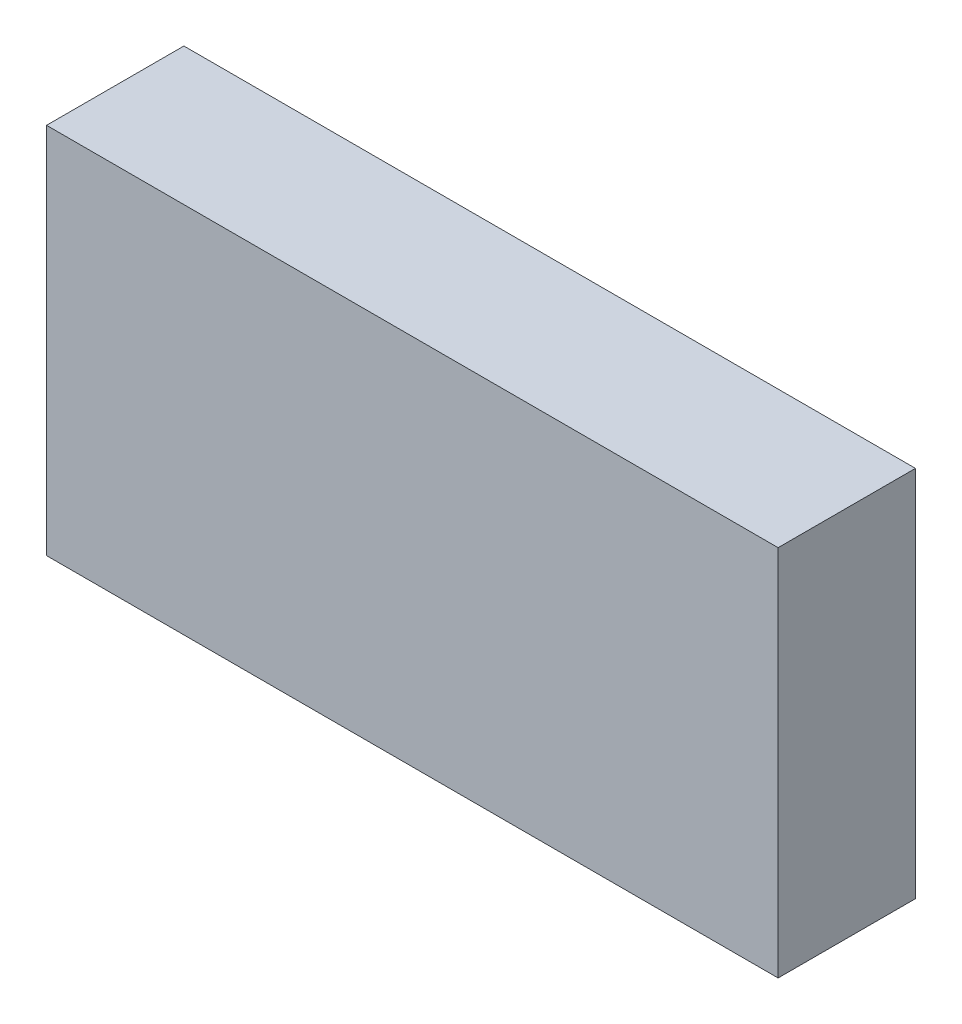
ISO-10303-21;
HEADER;
FILE_DESCRIPTION(('STEP AP214'),'2;1');
FILE_NAME('part.step','',(''),(''),'','','');
FILE_SCHEMA(('AUTOMOTIVE_DESIGN { 1 0 10303 214 1 1 1 1 }'));
ENDSEC;
DATA;
#1=APPLICATION_CONTEXT('core data for automotive mechanical design processes');
#2=APPLICATION_PROTOCOL_DEFINITION('international standard','automotive_design',2000,#1);
#3=PRODUCT_CONTEXT('',#1,'mechanical');
#4=PRODUCT('Part','Part','',(#3));
#5=PRODUCT_RELATED_PRODUCT_CATEGORY('part','',(#4));
#6=PRODUCT_DEFINITION_FORMATION('','',#4);
#7=PRODUCT_DEFINITION_CONTEXT('part definition',#1,'design');
#8=PRODUCT_DEFINITION('design','',#6,#7);
#9=PRODUCT_DEFINITION_SHAPE('','',#8);
#10=(LENGTH_UNIT() NAMED_UNIT(*) SI_UNIT(.MILLI.,.METRE.));
#11=(NAMED_UNIT(*) PLANE_ANGLE_UNIT() SI_UNIT($,.RADIAN.));
#12=(NAMED_UNIT(*) SI_UNIT($,.STERADIAN.) SOLID_ANGLE_UNIT());
#13=UNCERTAINTY_MEASURE_WITH_UNIT(LENGTH_MEASURE(1.E-05),#10,'distance_accuracy_value','');
#14=(GEOMETRIC_REPRESENTATION_CONTEXT(3) GLOBAL_UNCERTAINTY_ASSIGNED_CONTEXT((#13)) GLOBAL_UNIT_ASSIGNED_CONTEXT((#10,
#11,#12)) REPRESENTATION_CONTEXT('',''));
#15=CARTESIAN_POINT('',(0.,0.,0.));
#16=DIRECTION('',(0.,0.,1.));
#17=DIRECTION('',(1.,0.,0.));
#18=AXIS2_PLACEMENT_3D('',#15,#16,#17);
#19=CARTESIAN_POINT('',(-5.29999956,-2.69999968,1.99));
#20=DIRECTION('',(0.,0.,1.));
#21=DIRECTION('',(1.,0.,0.));
#22=AXIS2_PLACEMENT_3D('',#19,#20,#21);
#23=PLANE('',#22);
#24=DIRECTION('',(1.,0.,0.));
#25=VECTOR('',#24,1.);
#26=CARTESIAN_POINT('',(-5.29999956,2.69999968,1.99));
#27=LINE('',#26,#25);
#28=CARTESIAN_POINT('',(-5.29999956,2.69999968,1.99));
#29=VERTEX_POINT('',#28);
#30=CARTESIAN_POINT('',(5.29999956,2.69999968,1.99));
#31=VERTEX_POINT('',#30);
#32=EDGE_CURVE('E53',#29,#31,#27,.T.);
#33=ORIENTED_EDGE('',*,*,#32,.F.);
#34=DIRECTION('',(0.,1.,0.));
#35=VECTOR('',#34,1.);
#36=CARTESIAN_POINT('',(-5.29999956,-2.69999968,1.99));
#37=LINE('',#36,#35);
#38=CARTESIAN_POINT('',(-5.29999956,-2.69999968,1.99));
#39=VERTEX_POINT('',#38);
#40=EDGE_CURVE('E68',#39,#29,#37,.T.);
#41=ORIENTED_EDGE('',*,*,#40,.F.);
#42=DIRECTION('',(1.,0.,0.));
#43=VECTOR('',#42,1.);
#44=CARTESIAN_POINT('',(5.29999956,-2.69999968,1.99));
#45=LINE('',#44,#43);
#46=CARTESIAN_POINT('',(5.29999956,-2.69999968,1.99));
#47=VERTEX_POINT('',#46);
#48=EDGE_CURVE('E20',#47,#39,#45,.F.);
#49=ORIENTED_EDGE('',*,*,#48,.F.);
#50=DIRECTION('',(0.,1.,0.));
#51=VECTOR('',#50,1.);
#52=CARTESIAN_POINT('',(5.29999956,2.69999968,1.99));
#53=LINE('',#52,#51);
#54=EDGE_CURVE('E58',#31,#47,#53,.F.);
#55=ORIENTED_EDGE('',*,*,#54,.F.);
#56=EDGE_LOOP('',(#33,#41,#49,#55));
#57=FACE_BOUND('',#56,.T.);
#58=ADVANCED_FACE('F17',(#57),#23,.T.);
#59=CARTESIAN_POINT('',(5.29999956,-2.69999968,0.));
#60=DIRECTION('',(0.,-1.,0.));
#61=DIRECTION('',(0.,0.,-1.));
#62=AXIS2_PLACEMENT_3D('',#59,#60,#61);
#63=PLANE('',#62);
#64=DIRECTION('',(0.,0.,1.));
#65=VECTOR('',#64,1.);
#66=CARTESIAN_POINT('',(-5.29999956,-2.69999968,0.));
#67=LINE('',#66,#65);
#68=CARTESIAN_POINT('',(-5.29999956,-2.69999968,0.));
#69=VERTEX_POINT('',#68);
#70=EDGE_CURVE('E79',#69,#39,#67,.T.);
#71=ORIENTED_EDGE('',*,*,#70,.F.);
#72=DIRECTION('',(1.,0.,0.));
#73=VECTOR('',#72,1.);
#74=CARTESIAN_POINT('',(-5.29999956,-2.69999968,0.));
#75=LINE('',#74,#73);
#76=CARTESIAN_POINT('',(5.29999956,-2.69999968,0.));
#77=VERTEX_POINT('',#76);
#78=EDGE_CURVE('E74',#69,#77,#75,.T.);
#79=ORIENTED_EDGE('',*,*,#78,.T.);
#80=DIRECTION('',(0.,0.,-1.));
#81=VECTOR('',#80,1.);
#82=CARTESIAN_POINT('',(5.29999956,-2.69999968,0.));
#83=LINE('',#82,#81);
#84=EDGE_CURVE('E63',#47,#77,#83,.T.);
#85=ORIENTED_EDGE('',*,*,#84,.F.);
#86=ORIENTED_EDGE('',*,*,#48,.T.);
#87=EDGE_LOOP('',(#71,#79,#85,#86));
#88=FACE_BOUND('',#87,.T.);
#89=ADVANCED_FACE('F73',(#88),#63,.T.);
#90=CARTESIAN_POINT('',(5.29999956,2.69999968,0.));
#91=DIRECTION('',(1.,0.,0.));
#92=DIRECTION('',(0.,0.,-1.));
#93=AXIS2_PLACEMENT_3D('',#90,#91,#92);
#94=PLANE('',#93);
#95=ORIENTED_EDGE('',*,*,#84,.T.);
#96=DIRECTION('',(0.,1.,0.));
#97=VECTOR('',#96,1.);
#98=CARTESIAN_POINT('',(5.29999956,-2.69999968,0.));
#99=LINE('',#98,#97);
#100=CARTESIAN_POINT('',(5.29999956,2.69999968,0.));
#101=VERTEX_POINT('',#100);
#102=EDGE_CURVE('E84',#77,#101,#99,.T.);
#103=ORIENTED_EDGE('',*,*,#102,.T.);
#104=DIRECTION('',(0.,0.,1.));
#105=VECTOR('',#104,1.);
#106=CARTESIAN_POINT('',(5.29999956,2.69999968,0.));
#107=LINE('',#106,#105);
#108=EDGE_CURVE('E65',#31,#101,#107,.F.);
#109=ORIENTED_EDGE('',*,*,#108,.F.);
#110=ORIENTED_EDGE('',*,*,#54,.T.);
#111=EDGE_LOOP('',(#95,#103,#109,#110));
#112=FACE_BOUND('',#111,.T.);
#113=ADVANCED_FACE('F60',(#112),#94,.T.);
#114=CARTESIAN_POINT('',(-5.29999956,2.69999968,0.));
#115=DIRECTION('',(0.,1.,0.));
#116=DIRECTION('',(0.,0.,1.));
#117=AXIS2_PLACEMENT_3D('',#114,#115,#116);
#118=PLANE('',#117);
#119=ORIENTED_EDGE('',*,*,#108,.T.);
#120=DIRECTION('',(1.,0.,0.));
#121=VECTOR('',#120,1.);
#122=CARTESIAN_POINT('',(-5.29999956,2.69999968,0.));
#123=LINE('',#122,#121);
#124=CARTESIAN_POINT('',(-5.29999956,2.69999968,0.));
#125=VERTEX_POINT('',#124);
#126=EDGE_CURVE('E26',#101,#125,#123,.F.);
#127=ORIENTED_EDGE('',*,*,#126,.T.);
#128=DIRECTION('',(0.,0.,1.));
#129=VECTOR('',#128,1.);
#130=CARTESIAN_POINT('',(-5.29999956,2.69999968,0.));
#131=LINE('',#130,#129);
#132=EDGE_CURVE('E34',#29,#125,#131,.F.);
#133=ORIENTED_EDGE('',*,*,#132,.F.);
#134=ORIENTED_EDGE('',*,*,#32,.T.);
#135=EDGE_LOOP('',(#119,#127,#133,#134));
#136=FACE_BOUND('',#135,.T.);
#137=ADVANCED_FACE('F88',(#136),#118,.T.);
#138=CARTESIAN_POINT('',(-5.29999956,-2.69999968,0.));
#139=DIRECTION('',(-1.,0.,0.));
#140=DIRECTION('',(0.,0.,1.));
#141=AXIS2_PLACEMENT_3D('',#138,#139,#140);
#142=PLANE('',#141);
#143=ORIENTED_EDGE('',*,*,#132,.T.);
#144=DIRECTION('',(0.,1.,0.));
#145=VECTOR('',#144,1.);
#146=CARTESIAN_POINT('',(-5.29999956,-2.69999968,0.));
#147=LINE('',#146,#145);
#148=EDGE_CURVE('E11',#125,#69,#147,.F.);
#149=ORIENTED_EDGE('',*,*,#148,.T.);
#150=ORIENTED_EDGE('',*,*,#70,.T.);
#151=ORIENTED_EDGE('',*,*,#40,.T.);
#152=EDGE_LOOP('',(#143,#149,#150,#151));
#153=FACE_BOUND('',#152,.T.);
#154=ADVANCED_FACE('F91',(#153),#142,.T.);
#155=CARTESIAN_POINT('',(-5.29999956,-2.69999968,0.));
#156=DIRECTION('',(0.,0.,1.));
#157=DIRECTION('',(1.,0.,0.));
#158=AXIS2_PLACEMENT_3D('',#155,#156,#157);
#159=PLANE('',#158);
#160=ORIENTED_EDGE('',*,*,#126,.F.);
#161=ORIENTED_EDGE('',*,*,#102,.F.);
#162=ORIENTED_EDGE('',*,*,#78,.F.);
#163=ORIENTED_EDGE('',*,*,#148,.F.);
#164=EDGE_LOOP('',(#160,#161,#162,#163));
#165=FACE_BOUND('',#164,.T.);
#166=ADVANCED_FACE('F90',(#165),#159,.F.);
#167=CLOSED_SHELL('',(#58,#89,#113,#137,#154,#166));
#168=MANIFOLD_SOLID_BREP('B1',#167);
#169=ADVANCED_BREP_SHAPE_REPRESENTATION('',(#18,#168),#14);
#170=SHAPE_DEFINITION_REPRESENTATION(#9,#169);
ENDSEC;
END-ISO-10303-21;
